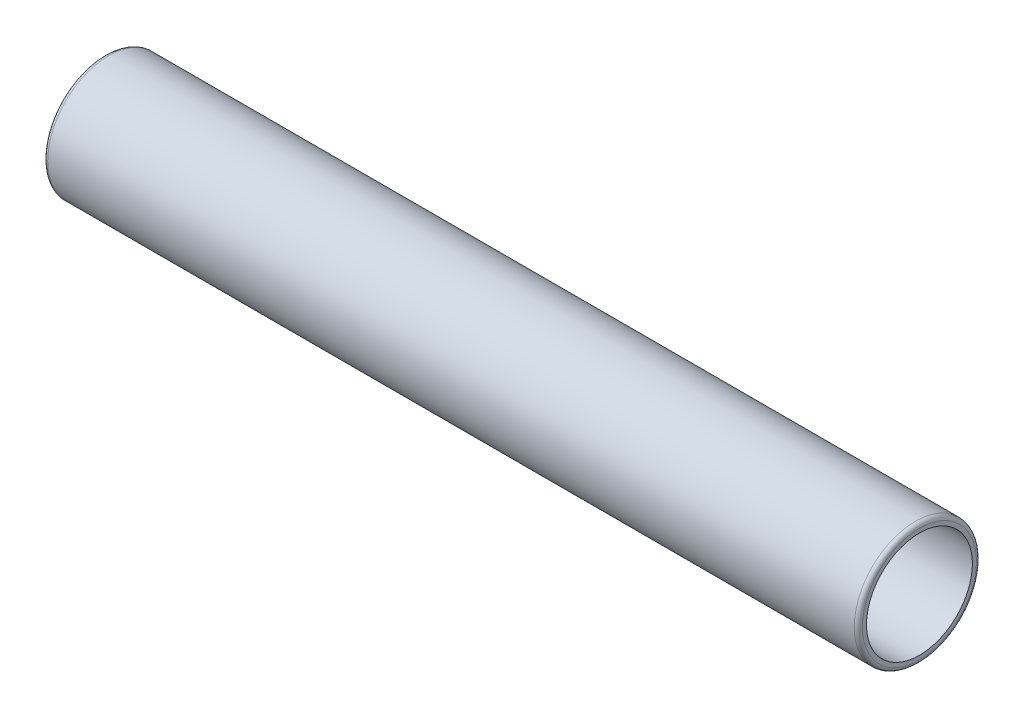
ISO-10303-21;
HEADER;
FILE_DESCRIPTION(('STEP AP214'),'2;1');
FILE_NAME('part.step','',(''),(''),'','','');
FILE_SCHEMA(('AUTOMOTIVE_DESIGN { 1 0 10303 214 1 1 1 1 }'));
ENDSEC;
DATA;
#1=APPLICATION_CONTEXT('core data for automotive mechanical design processes');
#2=APPLICATION_PROTOCOL_DEFINITION('international standard','automotive_design',2000,#1);
#3=PRODUCT_CONTEXT('',#1,'mechanical');
#4=PRODUCT('Part','Part','',(#3));
#5=PRODUCT_RELATED_PRODUCT_CATEGORY('part','',(#4));
#6=PRODUCT_DEFINITION_FORMATION('','',#4);
#7=PRODUCT_DEFINITION_CONTEXT('part definition',#1,'design');
#8=PRODUCT_DEFINITION('design','',#6,#7);
#9=PRODUCT_DEFINITION_SHAPE('','',#8);
#10=(LENGTH_UNIT() NAMED_UNIT(*) SI_UNIT(.MILLI.,.METRE.));
#11=(NAMED_UNIT(*) PLANE_ANGLE_UNIT() SI_UNIT($,.RADIAN.));
#12=(NAMED_UNIT(*) SI_UNIT($,.STERADIAN.) SOLID_ANGLE_UNIT());
#13=UNCERTAINTY_MEASURE_WITH_UNIT(LENGTH_MEASURE(1.E-05),#10,'distance_accuracy_value','');
#14=(GEOMETRIC_REPRESENTATION_CONTEXT(3) GLOBAL_UNCERTAINTY_ASSIGNED_CONTEXT((#13)) GLOBAL_UNIT_ASSIGNED_CONTEXT((#10,
#11,#12)) REPRESENTATION_CONTEXT('',''));
#15=CARTESIAN_POINT('',(0.,0.,0.));
#16=DIRECTION('',(0.,0.,1.));
#17=DIRECTION('',(1.,0.,0.));
#18=AXIS2_PLACEMENT_3D('',#15,#16,#17);
#19=CARTESIAN_POINT('',(0.,0.,0.));
#20=DIRECTION('',(-1.,0.,0.));
#21=DIRECTION('',(0.,0.,1.));
#22=AXIS2_PLACEMENT_3D('',#19,#20,#21);
#23=CYLINDRICAL_SURFACE('',#22,6.);
#24=CARTESIAN_POINT('',(6.,0.,0.));
#25=DIRECTION('',(-1.,0.,0.));
#26=DIRECTION('',(0.,0.,1.));
#27=AXIS2_PLACEMENT_3D('',#24,#25,#26);
#28=CIRCLE('',#27,6.);
#29=CARTESIAN_POINT('',(6.,0.,6.));
#30=VERTEX_POINT('',#29);
#31=EDGE_CURVE('E43',#30,#30,#28,.T.);
#32=ORIENTED_EDGE('',*,*,#31,.F.);
#33=EDGE_LOOP('',(#32));
#34=FACE_BOUND('',#33,.T.);
#35=CARTESIAN_POINT('',(0.,0.,0.));
#36=DIRECTION('',(-1.,0.,0.));
#37=DIRECTION('',(0.,0.,1.));
#38=AXIS2_PLACEMENT_3D('',#35,#36,#37);
#39=CIRCLE('',#38,6.);
#40=CARTESIAN_POINT('',(0.,0.,6.));
#41=VERTEX_POINT('',#40);
#42=EDGE_CURVE('E34',#41,#41,#39,.T.);
#43=ORIENTED_EDGE('',*,*,#42,.T.);
#44=EDGE_LOOP('',(#43));
#45=FACE_BOUND('',#44,.T.);
#46=ADVANCED_FACE('F14',(#34,#45),#23,.F.);
#47=CARTESIAN_POINT('',(0.,6.,0.));
#48=DIRECTION('',(1.,0.,0.));
#49=DIRECTION('',(0.,0.,-1.));
#50=AXIS2_PLACEMENT_3D('',#47,#48,#49);
#51=PLANE('',#50);
#52=CARTESIAN_POINT('',(0.,0.,0.));
#53=DIRECTION('',(1.,0.,0.));
#54=DIRECTION('',(0.,0.,-1.));
#55=AXIS2_PLACEMENT_3D('',#52,#53,#54);
#56=CIRCLE('',#55,14.);
#57=CARTESIAN_POINT('',(0.,0.,-14.));
#58=VERTEX_POINT('',#57);
#59=EDGE_CURVE('E21',#58,#58,#56,.F.);
#60=ORIENTED_EDGE('',*,*,#59,.T.);
#61=EDGE_LOOP('',(#60));
#62=FACE_BOUND('',#61,.T.);
#63=ORIENTED_EDGE('',*,*,#42,.F.);
#64=EDGE_LOOP('',(#63));
#65=FACE_BOUND('',#64,.T.);
#66=ADVANCED_FACE('F51',(#62,#65),#51,.F.);
#67=CARTESIAN_POINT('',(0.,0.,0.));
#68=DIRECTION('',(-1.,0.,0.));
#69=DIRECTION('',(0.,0.,1.));
#70=AXIS2_PLACEMENT_3D('',#67,#68,#69);
#71=CYLINDRICAL_SURFACE('',#70,15.);
#72=CARTESIAN_POINT('',(1.,0.,0.));
#73=DIRECTION('',(1.,0.,0.));
#74=DIRECTION('',(0.,0.,-1.));
#75=AXIS2_PLACEMENT_3D('',#72,#73,#74);
#76=CIRCLE('',#75,15.);
#77=CARTESIAN_POINT('',(1.,0.,-15.));
#78=VERTEX_POINT('',#77);
#79=EDGE_CURVE('E9',#78,#78,#76,.T.);
#80=ORIENTED_EDGE('',*,*,#79,.T.);
#81=EDGE_LOOP('',(#80));
#82=FACE_BOUND('',#81,.T.);
#83=CARTESIAN_POINT('',(199.,0.,0.));
#84=DIRECTION('',(-1.,0.,0.));
#85=DIRECTION('',(0.,0.,1.));
#86=AXIS2_PLACEMENT_3D('',#83,#84,#85);
#87=CIRCLE('',#86,15.);
#88=CARTESIAN_POINT('',(199.,0.,15.));
#89=VERTEX_POINT('',#88);
#90=EDGE_CURVE('E29',#89,#89,#87,.T.);
#91=ORIENTED_EDGE('',*,*,#90,.T.);
#92=EDGE_LOOP('',(#91));
#93=FACE_BOUND('',#92,.T.);
#94=ADVANCED_FACE('F56',(#82,#93),#71,.T.);
#95=CARTESIAN_POINT('',(200.,15.,0.));
#96=DIRECTION('',(-1.,0.,0.));
#97=DIRECTION('',(0.,0.,1.));
#98=AXIS2_PLACEMENT_3D('',#95,#96,#97);
#99=PLANE('',#98);
#100=CARTESIAN_POINT('',(200.,0.,0.));
#101=DIRECTION('',(-1.,0.,0.));
#102=DIRECTION('',(0.,0.,1.));
#103=AXIS2_PLACEMENT_3D('',#100,#101,#102);
#104=CIRCLE('',#103,14.);
#105=CARTESIAN_POINT('',(200.,0.,14.));
#106=VERTEX_POINT('',#105);
#107=EDGE_CURVE('E25',#106,#106,#104,.F.);
#108=ORIENTED_EDGE('',*,*,#107,.T.);
#109=EDGE_LOOP('',(#108));
#110=FACE_BOUND('',#109,.T.);
#111=CARTESIAN_POINT('',(200.,0.,0.));
#112=DIRECTION('',(-1.,0.,0.));
#113=DIRECTION('',(0.,0.,1.));
#114=AXIS2_PLACEMENT_3D('',#111,#112,#113);
#115=CIRCLE('',#114,13.);
#116=CARTESIAN_POINT('',(200.,0.,13.));
#117=VERTEX_POINT('',#116);
#118=EDGE_CURVE('E37',#117,#117,#115,.T.);
#119=ORIENTED_EDGE('',*,*,#118,.T.);
#120=EDGE_LOOP('',(#119));
#121=FACE_BOUND('',#120,.T.);
#122=ADVANCED_FACE('F63',(#110,#121),#99,.F.);
#123=CARTESIAN_POINT('',(0.,0.,0.));
#124=DIRECTION('',(-1.,0.,0.));
#125=DIRECTION('',(0.,0.,1.));
#126=AXIS2_PLACEMENT_3D('',#123,#124,#125);
#127=CYLINDRICAL_SURFACE('',#126,13.);
#128=ORIENTED_EDGE('',*,*,#118,.F.);
#129=EDGE_LOOP('',(#128));
#130=FACE_BOUND('',#129,.T.);
#131=CARTESIAN_POINT('',(13.,0.,0.));
#132=DIRECTION('',(-1.,0.,0.));
#133=DIRECTION('',(0.,0.,1.));
#134=AXIS2_PLACEMENT_3D('',#131,#132,#133);
#135=CIRCLE('',#134,13.);
#136=CARTESIAN_POINT('',(13.,0.,13.));
#137=VERTEX_POINT('',#136);
#138=EDGE_CURVE('E40',#137,#137,#135,.T.);
#139=ORIENTED_EDGE('',*,*,#138,.T.);
#140=EDGE_LOOP('',(#139));
#141=FACE_BOUND('',#140,.T.);
#142=ADVANCED_FACE('F75',(#130,#141),#127,.F.);
#143=CARTESIAN_POINT('',(6.,0.,0.));
#144=DIRECTION('',(1.,0.,0.));
#145=DIRECTION('',(0.,0.,-1.));
#146=AXIS2_PLACEMENT_3D('',#143,#144,#145);
#147=CONICAL_SURFACE('',#146,6.,0.785398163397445);
#148=ORIENTED_EDGE('',*,*,#138,.F.);
#149=EDGE_LOOP('',(#148));
#150=FACE_BOUND('',#149,.T.);
#151=ORIENTED_EDGE('',*,*,#31,.T.);
#152=EDGE_LOOP('',(#151));
#153=FACE_BOUND('',#152,.T.);
#154=ADVANCED_FACE('F47',(#150,#153),#147,.F.);
#155=CARTESIAN_POINT('',(199.,0.,0.));
#156=DIRECTION('',(-1.,0.,0.));
#157=DIRECTION('',(0.,0.,1.));
#158=AXIS2_PLACEMENT_3D('',#155,#156,#157);
#159=TOROIDAL_SURFACE('',#158,14.,1.);
#160=ORIENTED_EDGE('',*,*,#107,.F.);
#161=EDGE_LOOP('',(#160));
#162=FACE_BOUND('',#161,.T.);
#163=ORIENTED_EDGE('',*,*,#90,.F.);
#164=EDGE_LOOP('',(#163));
#165=FACE_BOUND('',#164,.T.);
#166=ADVANCED_FACE('F66',(#162,#165),#159,.T.);
#167=CARTESIAN_POINT('',(1.,0.,0.));
#168=DIRECTION('',(1.,0.,0.));
#169=DIRECTION('',(0.,0.,-1.));
#170=AXIS2_PLACEMENT_3D('',#167,#168,#169);
#171=TOROIDAL_SURFACE('',#170,14.,1.);
#172=ORIENTED_EDGE('',*,*,#79,.F.);
#173=EDGE_LOOP('',(#172));
#174=FACE_BOUND('',#173,.T.);
#175=ORIENTED_EDGE('',*,*,#59,.F.);
#176=EDGE_LOOP('',(#175));
#177=FACE_BOUND('',#176,.T.);
#178=ADVANCED_FACE('F16',(#174,#177),#171,.T.);
#179=CLOSED_SHELL('',(#46,#66,#94,#122,#142,#154,#166,#178));
#180=MANIFOLD_SOLID_BREP('B1',#179);
#181=ADVANCED_BREP_SHAPE_REPRESENTATION('',(#18,#180),#14);
#182=SHAPE_DEFINITION_REPRESENTATION(#9,#181);
ENDSEC;
END-ISO-10303-21;
